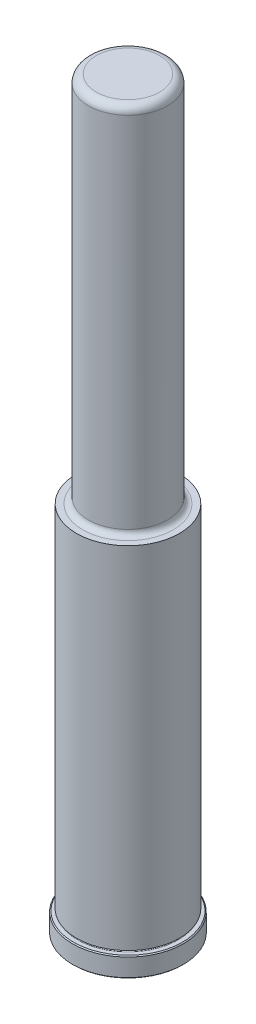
ISO-10303-21;
HEADER;
FILE_DESCRIPTION(('STEP AP214'),'2;1');
FILE_NAME('part.step','',(''),(''),'','','');
FILE_SCHEMA(('AUTOMOTIVE_DESIGN { 1 0 10303 214 1 1 1 1 }'));
ENDSEC;
DATA;
#1=APPLICATION_CONTEXT('core data for automotive mechanical design processes');
#2=APPLICATION_PROTOCOL_DEFINITION('international standard','automotive_design',2000,#1);
#3=PRODUCT_CONTEXT('',#1,'mechanical');
#4=PRODUCT('Part','Part','',(#3));
#5=PRODUCT_RELATED_PRODUCT_CATEGORY('part','',(#4));
#6=PRODUCT_DEFINITION_FORMATION('','',#4);
#7=PRODUCT_DEFINITION_CONTEXT('part definition',#1,'design');
#8=PRODUCT_DEFINITION('design','',#6,#7);
#9=PRODUCT_DEFINITION_SHAPE('','',#8);
#10=(LENGTH_UNIT() NAMED_UNIT(*) SI_UNIT(.MILLI.,.METRE.));
#11=(NAMED_UNIT(*) PLANE_ANGLE_UNIT() SI_UNIT($,.RADIAN.));
#12=(NAMED_UNIT(*) SI_UNIT($,.STERADIAN.) SOLID_ANGLE_UNIT());
#13=UNCERTAINTY_MEASURE_WITH_UNIT(LENGTH_MEASURE(1.E-05),#10,'distance_accuracy_value','');
#14=(GEOMETRIC_REPRESENTATION_CONTEXT(3) GLOBAL_UNCERTAINTY_ASSIGNED_CONTEXT((#13)) GLOBAL_UNIT_ASSIGNED_CONTEXT((#10,
#11,#12)) REPRESENTATION_CONTEXT('',''));
#15=CARTESIAN_POINT('',(0.,0.,0.));
#16=DIRECTION('',(0.,0.,1.));
#17=DIRECTION('',(1.,0.,0.));
#18=AXIS2_PLACEMENT_3D('',#15,#16,#17);
#19=CARTESIAN_POINT('',(0.,0.,0.));
#20=DIRECTION('',(0.,1.,0.));
#21=DIRECTION('',(0.,0.,1.));
#22=AXIS2_PLACEMENT_3D('',#19,#20,#21);
#23=PLANE('',#22);
#24=CARTESIAN_POINT('',(0.,0.,0.));
#25=DIRECTION('',(0.,1.,0.));
#26=DIRECTION('',(0.,0.,1.));
#27=AXIS2_PLACEMENT_3D('',#24,#25,#26);
#28=CIRCLE('',#27,21.844);
#29=CARTESIAN_POINT('',(0.,0.,21.844));
#30=VERTEX_POINT('',#29);
#31=EDGE_CURVE('E46',#30,#30,#28,.F.);
#32=ORIENTED_EDGE('',*,*,#31,.T.);
#33=EDGE_LOOP('',(#32));
#34=FACE_BOUND('',#33,.T.);
#35=ADVANCED_FACE('F31',(#34),#23,.F.);
#36=CARTESIAN_POINT('',(0.,0.,0.));
#37=DIRECTION('',(0.,1.,0.));
#38=DIRECTION('',(0.,0.,1.));
#39=AXIS2_PLACEMENT_3D('',#36,#37,#38);
#40=CYLINDRICAL_SURFACE('',#39,22.225);
#41=CARTESIAN_POINT('',(0.,0.380999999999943,0.));
#42=DIRECTION('',(0.,1.,0.));
#43=DIRECTION('',(0.,0.,1.));
#44=AXIS2_PLACEMENT_3D('',#41,#42,#43);
#45=CIRCLE('',#44,22.225);
#46=CARTESIAN_POINT('',(0.,0.38099999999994,22.225));
#47=VERTEX_POINT('',#46);
#48=EDGE_CURVE('E51',#47,#47,#45,.T.);
#49=ORIENTED_EDGE('',*,*,#48,.T.);
#50=EDGE_LOOP('',(#49));
#51=FACE_BOUND('',#50,.T.);
#52=CARTESIAN_POINT('',(0.,7.54379999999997,0.));
#53=DIRECTION('',(0.,-1.,0.));
#54=DIRECTION('',(0.,0.,-1.));
#55=AXIS2_PLACEMENT_3D('',#52,#53,#54);
#56=CIRCLE('',#55,22.225);
#57=CARTESIAN_POINT('',(0.,7.54379999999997,-22.225));
#58=VERTEX_POINT('',#57);
#59=EDGE_CURVE('E54',#58,#58,#56,.T.);
#60=ORIENTED_EDGE('',*,*,#59,.T.);
#61=EDGE_LOOP('',(#60));
#62=FACE_BOUND('',#61,.T.);
#63=ADVANCED_FACE('F110',(#51,#62),#40,.T.);
#64=CARTESIAN_POINT('',(0.,7.9248,-22.225));
#65=DIRECTION('',(0.,-1.,0.));
#66=DIRECTION('',(0.,0.,-1.));
#67=AXIS2_PLACEMENT_3D('',#64,#65,#66);
#68=PLANE('',#67);
#69=CARTESIAN_POINT('',(0.,7.9248,0.));
#70=DIRECTION('',(0.,-1.,0.));
#71=DIRECTION('',(0.,0.,-1.));
#72=AXIS2_PLACEMENT_3D('',#69,#70,#71);
#73=CIRCLE('',#72,21.844);
#74=CARTESIAN_POINT('',(0.,7.9248,-21.844));
#75=VERTEX_POINT('',#74);
#76=EDGE_CURVE('E42',#75,#75,#73,.F.);
#77=ORIENTED_EDGE('',*,*,#76,.T.);
#78=EDGE_LOOP('',(#77));
#79=FACE_BOUND('',#78,.T.);
#80=CARTESIAN_POINT('',(0.,7.9248,0.));
#81=DIRECTION('',(0.,1.,0.));
#82=DIRECTION('',(0.,0.,1.));
#83=AXIS2_PLACEMENT_3D('',#80,#81,#82);
#84=CIRCLE('',#83,20.2438);
#85=CARTESIAN_POINT('',(0.,7.92479999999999,20.2438));
#86=VERTEX_POINT('',#85);
#87=EDGE_CURVE('E57',#86,#86,#84,.T.);
#88=ORIENTED_EDGE('',*,*,#87,.F.);
#89=EDGE_LOOP('',(#88));
#90=FACE_BOUND('',#89,.T.);
#91=ADVANCED_FACE('F105',(#79,#90),#68,.F.);
#92=CARTESIAN_POINT('',(0.,8.3058,0.));
#93=DIRECTION('',(0.,1.,0.));
#94=DIRECTION('',(0.,0.,1.));
#95=AXIS2_PLACEMENT_3D('',#92,#93,#94);
#96=TOROIDAL_SURFACE('',#95,20.2438,0.380999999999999);
#97=CARTESIAN_POINT('',(0.,8.6868,0.));
#98=DIRECTION('',(0.,1.,0.));
#99=DIRECTION('',(0.,0.,1.));
#100=AXIS2_PLACEMENT_3D('',#97,#98,#99);
#101=CIRCLE('',#100,20.2438);
#102=CARTESIAN_POINT('',(0.,8.68679999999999,20.2438));
#103=VERTEX_POINT('',#102);
#104=EDGE_CURVE('E60',#103,#103,#101,.T.);
#105=ORIENTED_EDGE('',*,*,#104,.F.);
#106=EDGE_LOOP('',(#105));
#107=FACE_BOUND('',#106,.T.);
#108=ORIENTED_EDGE('',*,*,#87,.T.);
#109=EDGE_LOOP('',(#108));
#110=FACE_BOUND('',#109,.T.);
#111=ADVANCED_FACE('F99',(#107,#110),#96,.F.);
#112=CARTESIAN_POINT('',(0.,8.6868,-20.2438));
#113=DIRECTION('',(0.,1.,0.));
#114=DIRECTION('',(0.,0.,1.));
#115=AXIS2_PLACEMENT_3D('',#112,#113,#114);
#116=PLANE('',#115);
#117=CARTESIAN_POINT('',(0.,8.6868,0.));
#118=DIRECTION('',(0.,1.,0.));
#119=DIRECTION('',(0.,0.,1.));
#120=AXIS2_PLACEMENT_3D('',#117,#118,#119);
#121=CIRCLE('',#120,20.6502);
#122=CARTESIAN_POINT('',(0.,8.6868,20.6502));
#123=VERTEX_POINT('',#122);
#124=EDGE_CURVE('E63',#123,#123,#121,.T.);
#125=ORIENTED_EDGE('',*,*,#124,.F.);
#126=EDGE_LOOP('',(#125));
#127=FACE_BOUND('',#126,.T.);
#128=ORIENTED_EDGE('',*,*,#104,.T.);
#129=EDGE_LOOP('',(#128));
#130=FACE_BOUND('',#129,.T.);
#131=ADVANCED_FACE('F93',(#127,#130),#116,.F.);
#132=CARTESIAN_POINT('',(0.,0.,0.));
#133=DIRECTION('',(0.,1.,0.));
#134=DIRECTION('',(0.,0.,1.));
#135=AXIS2_PLACEMENT_3D('',#132,#133,#134);
#136=CYLINDRICAL_SURFACE('',#135,20.6502);
#137=CARTESIAN_POINT('',(0.,149.225,0.));
#138=DIRECTION('',(0.,1.,0.));
#139=DIRECTION('',(0.,0.,1.));
#140=AXIS2_PLACEMENT_3D('',#137,#138,#139);
#141=CIRCLE('',#140,20.6502);
#142=CARTESIAN_POINT('',(0.,149.225,20.6502));
#143=VERTEX_POINT('',#142);
#144=EDGE_CURVE('E66',#143,#143,#141,.T.);
#145=ORIENTED_EDGE('',*,*,#144,.F.);
#146=EDGE_LOOP('',(#145));
#147=FACE_BOUND('',#146,.T.);
#148=ORIENTED_EDGE('',*,*,#124,.T.);
#149=EDGE_LOOP('',(#148));
#150=FACE_BOUND('',#149,.T.);
#151=ADVANCED_FACE('F87',(#147,#150),#136,.T.);
#152=CARTESIAN_POINT('',(0.,149.225,-20.6502));
#153=DIRECTION('',(0.,-1.,0.));
#154=DIRECTION('',(0.,0.,-1.));
#155=AXIS2_PLACEMENT_3D('',#152,#153,#154);
#156=PLANE('',#155);
#157=CARTESIAN_POINT('',(0.,149.225,0.));
#158=DIRECTION('',(0.,1.,0.));
#159=DIRECTION('',(0.,0.,1.));
#160=AXIS2_PLACEMENT_3D('',#157,#158,#159);
#161=CIRCLE('',#160,18.1483);
#162=CARTESIAN_POINT('',(0.,149.225,18.1483));
#163=VERTEX_POINT('',#162);
#164=EDGE_CURVE('E69',#163,#163,#161,.T.);
#165=ORIENTED_EDGE('',*,*,#164,.F.);
#166=EDGE_LOOP('',(#165));
#167=FACE_BOUND('',#166,.T.);
#168=ORIENTED_EDGE('',*,*,#144,.T.);
#169=EDGE_LOOP('',(#168));
#170=FACE_BOUND('',#169,.T.);
#171=ADVANCED_FACE('F81',(#167,#170),#156,.F.);
#172=CARTESIAN_POINT('',(0.,151.511,0.));
#173=DIRECTION('',(0.,1.,0.));
#174=DIRECTION('',(0.,0.,1.));
#175=AXIS2_PLACEMENT_3D('',#172,#173,#174);
#176=TOROIDAL_SURFACE('',#175,18.1483,2.28599999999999);
#177=CARTESIAN_POINT('',(0.,151.511,0.));
#178=DIRECTION('',(0.,1.,0.));
#179=DIRECTION('',(0.,0.,1.));
#180=AXIS2_PLACEMENT_3D('',#177,#178,#179);
#181=CIRCLE('',#180,15.8623);
#182=CARTESIAN_POINT('',(0.,151.511,15.8623));
#183=VERTEX_POINT('',#182);
#184=EDGE_CURVE('E72',#183,#183,#181,.T.);
#185=ORIENTED_EDGE('',*,*,#184,.F.);
#186=EDGE_LOOP('',(#185));
#187=FACE_BOUND('',#186,.T.);
#188=ORIENTED_EDGE('',*,*,#164,.T.);
#189=EDGE_LOOP('',(#188));
#190=FACE_BOUND('',#189,.T.);
#191=ADVANCED_FACE('F78',(#187,#190),#176,.F.);
#192=CARTESIAN_POINT('',(0.,0.,0.));
#193=DIRECTION('',(0.,1.,0.));
#194=DIRECTION('',(0.,0.,1.));
#195=AXIS2_PLACEMENT_3D('',#192,#193,#194);
#196=CYLINDRICAL_SURFACE('',#195,15.8623);
#197=CARTESIAN_POINT('',(0.,295.275,0.));
#198=DIRECTION('',(0.,-1.,0.));
#199=DIRECTION('',(0.,0.,-1.));
#200=AXIS2_PLACEMENT_3D('',#197,#198,#199);
#201=CIRCLE('',#200,15.8623);
#202=CARTESIAN_POINT('',(0.,295.275,-15.8623));
#203=VERTEX_POINT('',#202);
#204=EDGE_CURVE('E10',#203,#203,#201,.T.);
#205=ORIENTED_EDGE('',*,*,#204,.T.);
#206=EDGE_LOOP('',(#205));
#207=FACE_BOUND('',#206,.T.);
#208=ORIENTED_EDGE('',*,*,#184,.T.);
#209=EDGE_LOOP('',(#208));
#210=FACE_BOUND('',#209,.T.);
#211=ADVANCED_FACE('F76',(#207,#210),#196,.T.);
#212=CARTESIAN_POINT('',(0.,298.45,-15.8623));
#213=DIRECTION('',(0.,-1.,0.));
#214=DIRECTION('',(0.,0.,-1.));
#215=AXIS2_PLACEMENT_3D('',#212,#213,#214);
#216=PLANE('',#215);
#217=CARTESIAN_POINT('',(0.,298.45,0.));
#218=DIRECTION('',(0.,-1.,0.));
#219=DIRECTION('',(0.,0.,-1.));
#220=AXIS2_PLACEMENT_3D('',#217,#218,#219);
#221=CIRCLE('',#220,12.6873);
#222=CARTESIAN_POINT('',(0.,298.45,-12.6873));
#223=VERTEX_POINT('',#222);
#224=EDGE_CURVE('E38',#223,#223,#221,.F.);
#225=ORIENTED_EDGE('',*,*,#224,.T.);
#226=EDGE_LOOP('',(#225));
#227=FACE_BOUND('',#226,.T.);
#228=ADVANCED_FACE('F127',(#227),#216,.F.);
#229=CARTESIAN_POINT('',(0.,0.380999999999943,0.));
#230=DIRECTION('',(0.,1.,0.));
#231=DIRECTION('',(0.,0.,1.));
#232=AXIS2_PLACEMENT_3D('',#229,#230,#231);
#233=CONICAL_SURFACE('',#232,22.225,0.785398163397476);
#234=ORIENTED_EDGE('',*,*,#31,.F.);
#235=EDGE_LOOP('',(#234));
#236=FACE_BOUND('',#235,.T.);
#237=ORIENTED_EDGE('',*,*,#48,.F.);
#238=EDGE_LOOP('',(#237));
#239=FACE_BOUND('',#238,.T.);
#240=ADVANCED_FACE('F124',(#236,#239),#233,.T.);
#241=CARTESIAN_POINT('',(0.,7.9248,0.));
#242=DIRECTION('',(0.,-1.,0.));
#243=DIRECTION('',(0.,0.,-1.));
#244=AXIS2_PLACEMENT_3D('',#241,#242,#243);
#245=CONICAL_SURFACE('',#244,21.844,0.785398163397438);
#246=CARTESIAN_POINT('',(0.,7.54379999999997,-22.225));
#247=CARTESIAN_POINT('',(0.,7.54776874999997,-22.22103125));
#248=CARTESIAN_POINT('',(0.,7.55173749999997,-22.2170625));
#249=CARTESIAN_POINT('',(0.,7.55967499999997,-22.209125));
#250=CARTESIAN_POINT('',(0.,7.56364374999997,-22.20515625));
#251=CARTESIAN_POINT('',(0.,7.57158124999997,-22.19721875));
#252=CARTESIAN_POINT('',(0.,7.57554999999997,-22.19325));
#253=CARTESIAN_POINT('',(0.,7.58348749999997,-22.1853125));
#254=CARTESIAN_POINT('',(0.,7.58745624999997,-22.18134375));
#255=CARTESIAN_POINT('',(0.,7.59539374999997,-22.17340625));
#256=CARTESIAN_POINT('',(0.,7.59936249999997,-22.1694375));
#257=CARTESIAN_POINT('',(0.,7.60729999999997,-22.1615));
#258=CARTESIAN_POINT('',(0.,7.61126874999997,-22.15753125));
#259=CARTESIAN_POINT('',(0.,7.61920624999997,-22.14959375));
#260=CARTESIAN_POINT('',(0.,7.62317499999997,-22.145625));
#261=CARTESIAN_POINT('',(0.,7.63111249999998,-22.1376875));
#262=CARTESIAN_POINT('',(0.,7.63508124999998,-22.13371875));
#263=CARTESIAN_POINT('',(0.,7.64301874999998,-22.12578125));
#264=CARTESIAN_POINT('',(0.,7.64698749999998,-22.1218125));
#265=CARTESIAN_POINT('',(0.,7.65492499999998,-22.113875));
#266=CARTESIAN_POINT('',(0.,7.65889374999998,-22.10990625));
#267=CARTESIAN_POINT('',(0.,7.66683124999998,-22.10196875));
#268=CARTESIAN_POINT('',(0.,7.67079999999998,-22.098));
#269=CARTESIAN_POINT('',(0.,7.67873749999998,-22.0900625));
#270=CARTESIAN_POINT('',(0.,7.68270624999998,-22.08609375));
#271=CARTESIAN_POINT('',(0.,7.69064374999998,-22.07815625));
#272=CARTESIAN_POINT('',(0.,7.69461249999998,-22.0741875));
#273=CARTESIAN_POINT('',(0.,7.70254999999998,-22.06625));
#274=CARTESIAN_POINT('',(0.,7.70651874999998,-22.06228125));
#275=CARTESIAN_POINT('',(0.,7.71445624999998,-22.05434375));
#276=CARTESIAN_POINT('',(0.,7.71842499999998,-22.050375));
#277=CARTESIAN_POINT('',(0.,7.72636249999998,-22.0424375));
#278=CARTESIAN_POINT('',(0.,7.73033124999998,-22.03846875));
#279=CARTESIAN_POINT('',(0.,7.73826874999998,-22.03053125));
#280=CARTESIAN_POINT('',(0.,7.74223749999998,-22.0265625));
#281=CARTESIAN_POINT('',(0.,7.75017499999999,-22.018625));
#282=CARTESIAN_POINT('',(0.,7.75414374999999,-22.01465625));
#283=CARTESIAN_POINT('',(0.,7.76208124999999,-22.00671875));
#284=CARTESIAN_POINT('',(0.,7.76604999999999,-22.00275));
#285=CARTESIAN_POINT('',(0.,7.77398749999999,-21.9948125));
#286=CARTESIAN_POINT('',(0.,7.77795624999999,-21.99084375));
#287=CARTESIAN_POINT('',(0.,7.78589374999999,-21.98290625));
#288=CARTESIAN_POINT('',(0.,7.78986249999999,-21.9789375));
#289=CARTESIAN_POINT('',(0.,7.79779999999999,-21.971));
#290=CARTESIAN_POINT('',(0.,7.80176874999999,-21.96703125));
#291=CARTESIAN_POINT('',(0.,7.80970624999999,-21.95909375));
#292=CARTESIAN_POINT('',(0.,7.81367499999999,-21.955125));
#293=CARTESIAN_POINT('',(0.,7.82161249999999,-21.9471875));
#294=CARTESIAN_POINT('',(0.,7.82558124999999,-21.94321875));
#295=CARTESIAN_POINT('',(0.,7.83351874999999,-21.93528125));
#296=CARTESIAN_POINT('',(0.,7.83748749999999,-21.9313125));
#297=CARTESIAN_POINT('',(0.,7.84542499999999,-21.923375));
#298=CARTESIAN_POINT('',(0.,7.84939374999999,-21.91940625));
#299=CARTESIAN_POINT('',(0.,7.85733124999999,-21.91146875));
#300=CARTESIAN_POINT('',(0.,7.86129999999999,-21.9075));
#301=CARTESIAN_POINT('',(0.,7.8692375,-21.8995625));
#302=CARTESIAN_POINT('',(0.,7.87320625,-21.89559375));
#303=CARTESIAN_POINT('',(0.,7.88114375,-21.88765625));
#304=CARTESIAN_POINT('',(0.,7.8851125,-21.8836875));
#305=CARTESIAN_POINT('',(0.,7.89305,-21.87575));
#306=CARTESIAN_POINT('',(0.,7.89701875,-21.87178125));
#307=CARTESIAN_POINT('',(0.,7.90495625,-21.86384375));
#308=CARTESIAN_POINT('',(0.,7.908925,-21.859875));
#309=CARTESIAN_POINT('',(0.,7.9168625,-21.8519375));
#310=CARTESIAN_POINT('',(0.,7.92083125,-21.84796875));
#311=CARTESIAN_POINT('',(0.,7.9248,-21.844));
#312=B_SPLINE_CURVE_WITH_KNOTS('',3,(#246,#247,#248,#249,#250,#251,#252,#253,#254,#255,#256,
#257,#258,#259,#260,#261,#262,#263,#264,#265,#266,#267,#268,#269,#270,#271,#272,#273,#274,#275,
#276,#277,#278,#279,#280,#281,#282,#283,#284,#285,#286,#287,#288,#289,#290,#291,#292,#293,#294,
#295,#296,#297,#298,#299,#300,#301,#302,#303,#304,#305,#306,#307,#308,#309,#310,#311),
.UNSPECIFIED.,.F.,.F.,(4,2,2,2,2,2,2,2,2,2,2,2,2,2,2,2,2,2,2,2,2,2,2,2,2,2,2,2,2,2,2,2,4),(0.,
0.0168379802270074,0.0336759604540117,0.0505139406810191,0.0673519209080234,0.0841899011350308,
0.101027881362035,0.117865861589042,0.134703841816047,0.151541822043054,0.168379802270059,
0.185217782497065,0.202055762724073,0.218893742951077,0.235731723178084,0.252569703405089,
0.269407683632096,0.286245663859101,0.303083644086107,0.319921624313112,0.336759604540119,
0.353597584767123,0.370435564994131,0.387273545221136,0.404111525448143,0.420949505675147,
0.437787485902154,0.45462546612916,0.471463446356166,0.488301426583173,0.505139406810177,
0.521977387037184,0.538815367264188),.UNSPECIFIED.);
#313=EDGE_CURVE('BSEAM126',#58,#75,#312,.T.);
#314=ORIENTED_EDGE('',*,*,#59,.F.);
#315=ORIENTED_EDGE('',*,*,#76,.F.);
#316=ORIENTED_EDGE('',*,*,#313,.T.);
#317=ORIENTED_EDGE('',*,*,#313,.F.);
#318=EDGE_LOOP('',(#314,#316,#315,#317));
#319=FACE_BOUND('',#318,.T.);
#320=ADVANCED_FACE('F126',(#319),#245,.T.);
#321=CARTESIAN_POINT('',(0.,295.275,0.));
#322=DIRECTION('',(0.,-1.,0.));
#323=DIRECTION('',(0.,0.,-1.));
#324=AXIS2_PLACEMENT_3D('',#321,#322,#323);
#325=TOROIDAL_SURFACE('',#324,12.6873,3.175);
#326=ORIENTED_EDGE('',*,*,#204,.F.);
#327=EDGE_LOOP('',(#326));
#328=FACE_BOUND('',#327,.T.);
#329=ORIENTED_EDGE('',*,*,#224,.F.);
#330=EDGE_LOOP('',(#329));
#331=FACE_BOUND('',#330,.T.);
#332=ADVANCED_FACE('F33',(#328,#331),#325,.T.);
#333=CLOSED_SHELL('',(#35,#63,#91,#111,#131,#151,#171,#191,#211,#228,#240,#320,#332));
#334=MANIFOLD_SOLID_BREP('B2',#333);
#335=ADVANCED_BREP_SHAPE_REPRESENTATION('',(#18,#334),#14);
#336=SHAPE_DEFINITION_REPRESENTATION(#9,#335);
ENDSEC;
END-ISO-10303-21;
